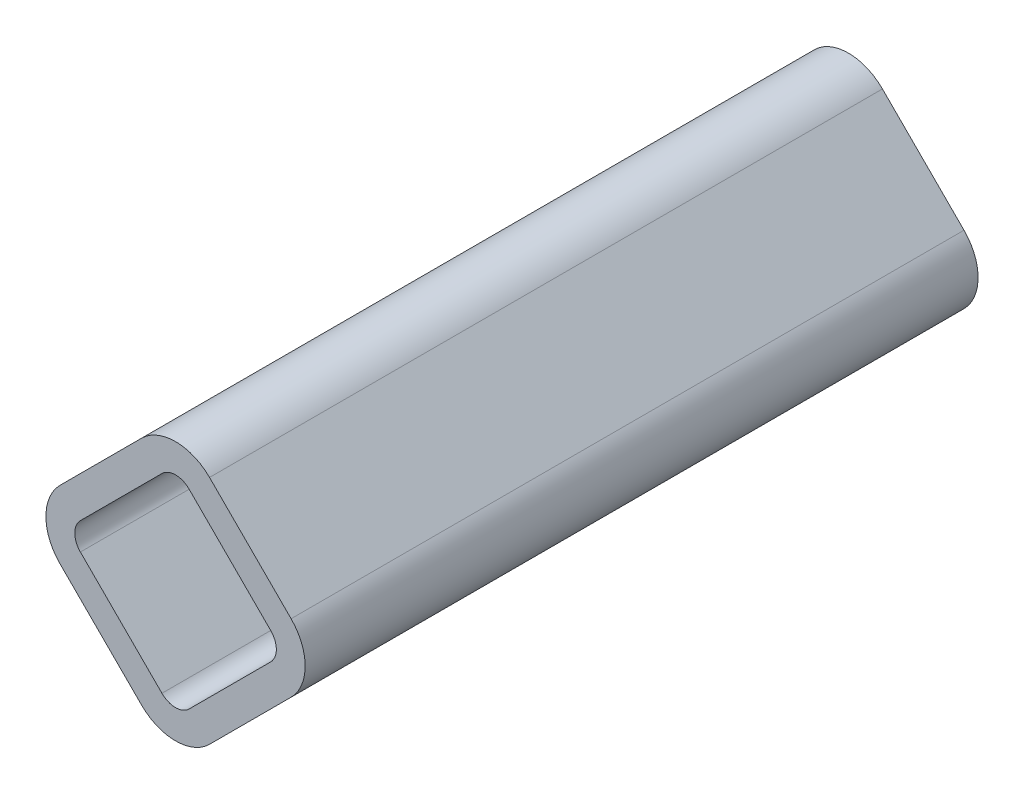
ISO-10303-21;
HEADER;
FILE_DESCRIPTION(('STEP AP214'),'2;1');
FILE_NAME('part.step','',(''),(''),'','','');
FILE_SCHEMA(('AUTOMOTIVE_DESIGN { 1 0 10303 214 1 1 1 1 }'));
ENDSEC;
DATA;
#1=APPLICATION_CONTEXT('core data for automotive mechanical design processes');
#2=APPLICATION_PROTOCOL_DEFINITION('international standard','automotive_design',2000,#1);
#3=PRODUCT_CONTEXT('',#1,'mechanical');
#4=PRODUCT('Part','Part','',(#3));
#5=PRODUCT_RELATED_PRODUCT_CATEGORY('part','',(#4));
#6=PRODUCT_DEFINITION_FORMATION('','',#4);
#7=PRODUCT_DEFINITION_CONTEXT('part definition',#1,'design');
#8=PRODUCT_DEFINITION('design','',#6,#7);
#9=PRODUCT_DEFINITION_SHAPE('','',#8);
#10=(LENGTH_UNIT() NAMED_UNIT(*) SI_UNIT(.MILLI.,.METRE.));
#11=(NAMED_UNIT(*) PLANE_ANGLE_UNIT() SI_UNIT($,.RADIAN.));
#12=(NAMED_UNIT(*) SI_UNIT($,.STERADIAN.) SOLID_ANGLE_UNIT());
#13=UNCERTAINTY_MEASURE_WITH_UNIT(LENGTH_MEASURE(1.E-05),#10,'distance_accuracy_value','');
#14=(GEOMETRIC_REPRESENTATION_CONTEXT(3) GLOBAL_UNCERTAINTY_ASSIGNED_CONTEXT((#13)) GLOBAL_UNIT_ASSIGNED_CONTEXT((#10,
#11,#12)) REPRESENTATION_CONTEXT('',''));
#15=CARTESIAN_POINT('',(0.,0.,0.));
#16=DIRECTION('',(0.,0.,1.));
#17=DIRECTION('',(1.,0.,0.));
#18=AXIS2_PLACEMENT_3D('',#15,#16,#17);
#19=CARTESIAN_POINT('',(-1.55771785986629E-08,4.24264070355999,11.));
#20=DIRECTION('',(0.,0.,1.));
#21=DIRECTION('',(0.,-1.,0.));
#22=AXIS2_PLACEMENT_3D('',#19,#20,#21);
#23=CYLINDRICAL_SURFACE('',#22,1.00000000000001);
#24=CARTESIAN_POINT('',(-1.55771785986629E-08,4.24264070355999,11.));
#25=DIRECTION('',(0.,0.,1.));
#26=DIRECTION('',(0.,-1.,0.));
#27=AXIS2_PLACEMENT_3D('',#24,#25,#26);
#28=CIRCLE('',#27,1.00000000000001);
#29=CARTESIAN_POINT('',(-0.707106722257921,4.94974755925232,11.));
#30=VERTEX_POINT('',#29);
#31=CARTESIAN_POINT('',(0.707106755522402,4.94974749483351,11.));
#32=VERTEX_POINT('',#31);
#33=EDGE_CURVE('E127',#30,#32,#28,.F.);
#34=ORIENTED_EDGE('',*,*,#33,.T.);
#35=DIRECTION('',(0.,0.,-1.));
#36=VECTOR('',#35,1.);
#37=CARTESIAN_POINT('',(0.707106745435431,4.94974750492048,28.5));
#38=LINE('',#37,#36);
#39=CARTESIAN_POINT('',(0.70710675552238,4.94974749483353,46.));
#40=VERTEX_POINT('',#39);
#41=EDGE_CURVE('E125',#40,#32,#38,.T.);
#42=ORIENTED_EDGE('',*,*,#41,.F.);
#43=CARTESIAN_POINT('',(-1.55771785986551E-08,4.24264070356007,46.));
#44=DIRECTION('',(0.,0.,1.));
#45=DIRECTION('',(0.,-1.,0.));
#46=AXIS2_PLACEMENT_3D('',#43,#44,#45);
#47=CIRCLE('',#46,1.00000000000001);
#48=CARTESIAN_POINT('',(-0.7071067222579,4.94974755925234,46.));
#49=VERTEX_POINT('',#48);
#50=EDGE_CURVE('E20',#40,#49,#47,.T.);
#51=ORIENTED_EDGE('',*,*,#50,.T.);
#52=DIRECTION('',(0.,0.,1.));
#53=VECTOR('',#52,1.);
#54=CARTESIAN_POINT('',(-0.707106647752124,4.94974763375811,28.5));
#55=LINE('',#54,#53);
#56=EDGE_CURVE('E122',#30,#49,#55,.T.);
#57=ORIENTED_EDGE('',*,*,#56,.F.);
#58=EDGE_LOOP('',(#34,#42,#51,#57));
#59=FACE_BOUND('',#58,.T.);
#60=ADVANCED_FACE('F16',(#59),#23,.F.);
#61=CARTESIAN_POINT('',(1.76069614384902,-6.01747830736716,10.99));
#62=DIRECTION('',(0.707106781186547,-0.707106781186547,0.));
#63=DIRECTION('',(0.707106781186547,0.707106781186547,0.));
#64=AXIS2_PLACEMENT_3D('',#61,#62,#63);
#65=PLANE('',#64);
#66=DIRECTION('',(-0.707106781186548,-0.707106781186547,0.));
#67=VECTOR('',#66,1.);
#68=CARTESIAN_POINT('',(6.01040765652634,-1.76776679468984,11.));
#69=LINE('',#68,#67);
#70=CARTESIAN_POINT('',(6.01040768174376,-1.76776676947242,11.));
#71=VERTEX_POINT('',#70);
#72=CARTESIAN_POINT('',(1.76776721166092,-6.01040723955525,11.));
#73=VERTEX_POINT('',#72);
#74=EDGE_CURVE('E219',#71,#73,#69,.T.);
#75=ORIENTED_EDGE('',*,*,#74,.F.);
#76=DIRECTION('',(0.,0.,-1.));
#77=VECTOR('',#76,1.);
#78=CARTESIAN_POINT('',(6.01040765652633,-1.76776679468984,28.5));
#79=LINE('',#78,#77);
#80=CARTESIAN_POINT('',(6.01040768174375,-1.76776676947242,46.));
#81=VERTEX_POINT('',#80);
#82=EDGE_CURVE('E247',#81,#71,#79,.T.);
#83=ORIENTED_EDGE('',*,*,#82,.F.);
#84=DIRECTION('',(0.707106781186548,0.707106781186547,0.));
#85=VECTOR('',#84,1.);
#86=CARTESIAN_POINT('',(1.76776721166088,-6.01040723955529,46.));
#87=LINE('',#86,#85);
#88=CARTESIAN_POINT('',(1.76776721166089,-6.01040723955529,46.));
#89=VERTEX_POINT('',#88);
#90=EDGE_CURVE('E169',#89,#81,#87,.T.);
#91=ORIENTED_EDGE('',*,*,#90,.F.);
#92=DIRECTION('',(0.,0.,1.));
#93=VECTOR('',#92,1.);
#94=CARTESIAN_POINT('',(1.76776721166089,-6.01040723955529,28.5));
#95=LINE('',#94,#93);
#96=EDGE_CURVE('E174',#73,#89,#95,.T.);
#97=ORIENTED_EDGE('',*,*,#96,.F.);
#98=EDGE_LOOP('',(#75,#83,#91,#97));
#99=FACE_BOUND('',#98,.T.);
#100=ADVANCED_FACE('F275',(#99),#65,.T.);
#101=CARTESIAN_POINT('',(2.58694522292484E-07,-4.24264028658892,46.));
#102=DIRECTION('',(0.,0.,-1.));
#103=DIRECTION('',(0.,1.,0.));
#104=AXIS2_PLACEMENT_3D('',#101,#102,#103);
#105=CYLINDRICAL_SURFACE('',#104,2.5);
#106=CARTESIAN_POINT('',(2.58694522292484E-07,-4.24264028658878,11.));
#107=DIRECTION('',(0.,0.,-1.));
#108=DIRECTION('',(0.,1.,0.));
#109=AXIS2_PLACEMENT_3D('',#106,#107,#108);
#110=CIRCLE('',#109,2.5);
#111=CARTESIAN_POINT('',(-1.76776669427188,-6.01040723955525,11.));
#112=VERTEX_POINT('',#111);
#113=EDGE_CURVE('E216',#73,#112,#110,.T.);
#114=ORIENTED_EDGE('',*,*,#113,.F.);
#115=ORIENTED_EDGE('',*,*,#96,.T.);
#116=CARTESIAN_POINT('',(2.58694522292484E-07,-4.24264028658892,46.));
#117=DIRECTION('',(0.,0.,-1.));
#118=DIRECTION('',(0.,1.,0.));
#119=AXIS2_PLACEMENT_3D('',#116,#117,#118);
#120=CIRCLE('',#119,2.5);
#121=CARTESIAN_POINT('',(-1.76776669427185,-6.01040723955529,46.));
#122=VERTEX_POINT('',#121);
#123=EDGE_CURVE('E172',#122,#89,#120,.F.);
#124=ORIENTED_EDGE('',*,*,#123,.F.);
#125=DIRECTION('',(0.,0.,1.));
#126=VECTOR('',#125,1.);
#127=CARTESIAN_POINT('',(-1.76776669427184,-6.01040723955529,28.5));
#128=LINE('',#127,#126);
#129=EDGE_CURVE('E175',#112,#122,#128,.T.);
#130=ORIENTED_EDGE('',*,*,#129,.F.);
#131=EDGE_LOOP('',(#114,#115,#124,#130));
#132=FACE_BOUND('',#131,.T.);
#133=ADVANCED_FACE('F272',(#132),#105,.T.);
#134=CARTESIAN_POINT('',(-6.01747832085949,-1.76069561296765,10.99));
#135=DIRECTION('',(-0.707106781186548,-0.707106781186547,0.));
#136=DIRECTION('',(0.707106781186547,-0.707106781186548,0.));
#137=AXIS2_PLACEMENT_3D('',#134,#135,#136);
#138=PLANE('',#137);
#139=DIRECTION('',(-0.707106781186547,0.707106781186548,0.));
#140=VECTOR('',#139,1.);
#141=CARTESIAN_POINT('',(-1.76776669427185,-6.01040723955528,11.));
#142=LINE('',#141,#140);
#143=CARTESIAN_POINT('',(-6.01040722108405,-1.76776671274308,11.));
#144=VERTEX_POINT('',#143);
#145=EDGE_CURVE('E213',#112,#144,#142,.T.);
#146=ORIENTED_EDGE('',*,*,#145,.F.);
#147=ORIENTED_EDGE('',*,*,#129,.T.);
#148=DIRECTION('',(0.707106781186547,-0.707106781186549,0.));
#149=VECTOR('',#148,1.);
#150=CARTESIAN_POINT('',(-6.01040725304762,-1.76776668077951,46.));
#151=LINE('',#150,#149);
#152=CARTESIAN_POINT('',(-6.01040722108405,-1.76776671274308,46.));
#153=VERTEX_POINT('',#152);
#154=EDGE_CURVE('E148',#153,#122,#151,.T.);
#155=ORIENTED_EDGE('',*,*,#154,.F.);
#156=DIRECTION('',(0.,0.,1.));
#157=VECTOR('',#156,1.);
#158=CARTESIAN_POINT('',(-6.01040725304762,-1.76776668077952,28.5));
#159=LINE('',#158,#157);
#160=EDGE_CURVE('E181',#144,#153,#159,.T.);
#161=ORIENTED_EDGE('',*,*,#160,.F.);
#162=EDGE_LOOP('',(#146,#147,#155,#161));
#163=FACE_BOUND('',#162,.T.);
#164=ADVANCED_FACE('F263',(#163),#138,.T.);
#165=CARTESIAN_POINT('',(-4.24264023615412,2.08259709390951E-07,46.));
#166=DIRECTION('',(0.,0.,-1.));
#167=DIRECTION('',(-1.,0.,0.));
#168=AXIS2_PLACEMENT_3D('',#165,#166,#167);
#169=CYLINDRICAL_SURFACE('',#168,2.5);
#170=CARTESIAN_POINT('',(-4.24264023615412,2.08259709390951E-07,11.));
#171=DIRECTION('',(0.,0.,-1.));
#172=DIRECTION('',(-1.,0.,0.));
#173=AXIS2_PLACEMENT_3D('',#170,#171,#172);
#174=CIRCLE('',#173,2.5);
#175=CARTESIAN_POINT('',(-6.01040742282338,1.76776692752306,11.));
#176=VERTEX_POINT('',#175);
#177=EDGE_CURVE('E210',#144,#176,#174,.T.);
#178=ORIENTED_EDGE('',*,*,#177,.F.);
#179=ORIENTED_EDGE('',*,*,#160,.T.);
#180=CARTESIAN_POINT('',(-4.24264023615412,2.08259709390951E-07,46.));
#181=DIRECTION('',(0.,0.,-1.));
#182=DIRECTION('',(-1.,0.,0.));
#183=AXIS2_PLACEMENT_3D('',#180,#181,#182);
#184=CIRCLE('',#183,2.5);
#185=CARTESIAN_POINT('',(-6.01040742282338,1.76776692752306,46.));
#186=VERTEX_POINT('',#185);
#187=EDGE_CURVE('E154',#186,#153,#184,.F.);
#188=ORIENTED_EDGE('',*,*,#187,.F.);
#189=DIRECTION('',(0.,0.,1.));
#190=VECTOR('',#189,1.);
#191=CARTESIAN_POINT('',(-6.01040765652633,1.76776669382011,28.5));
#192=LINE('',#191,#190);
#193=EDGE_CURVE('E255',#176,#186,#192,.T.);
#194=ORIENTED_EDGE('',*,*,#193,.F.);
#195=EDGE_LOOP('',(#178,#179,#188,#194));
#196=FACE_BOUND('',#195,.T.);
#197=ADVANCED_FACE('F260',(#196),#169,.T.);
#198=CARTESIAN_POINT('',(-1.76069562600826,6.01747872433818,10.99));
#199=DIRECTION('',(-0.707106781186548,0.707106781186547,0.));
#200=DIRECTION('',(-0.707106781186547,-0.707106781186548,0.));
#201=AXIS2_PLACEMENT_3D('',#198,#199,#200);
#202=PLANE('',#201);
#203=DIRECTION('',(0.707106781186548,0.707106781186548,0.));
#204=VECTOR('',#203,1.);
#205=CARTESIAN_POINT('',(-6.01040765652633,1.76776669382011,11.));
#206=LINE('',#205,#204);
#207=CARTESIAN_POINT('',(-1.76776669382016,6.01040765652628,11.));
#208=VERTEX_POINT('',#207);
#209=EDGE_CURVE('E207',#176,#208,#206,.T.);
#210=ORIENTED_EDGE('',*,*,#209,.F.);
#211=ORIENTED_EDGE('',*,*,#193,.T.);
#212=DIRECTION('',(-0.707106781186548,-0.707106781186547,0.));
#213=VECTOR('',#212,1.);
#214=CARTESIAN_POINT('',(-1.76776669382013,6.01040765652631,46.));
#215=LINE('',#214,#213);
#216=CARTESIAN_POINT('',(-1.76776669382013,6.01040765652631,46.));
#217=VERTEX_POINT('',#216);
#218=EDGE_CURVE('E157',#217,#186,#215,.T.);
#219=ORIENTED_EDGE('',*,*,#218,.F.);
#220=DIRECTION('',(0.,0.,1.));
#221=VECTOR('',#220,1.);
#222=CARTESIAN_POINT('',(-1.76776669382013,6.01040765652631,28.5));
#223=LINE('',#222,#221);
#224=EDGE_CURVE('E253',#208,#217,#223,.T.);
#225=ORIENTED_EDGE('',*,*,#224,.F.);
#226=EDGE_LOOP('',(#210,#211,#219,#225));
#227=FACE_BOUND('',#226,.T.);
#228=ADVANCED_FACE('F268',(#227),#202,.T.);
#229=CARTESIAN_POINT('',(2.59146241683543E-07,4.24264070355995,46.));
#230=DIRECTION('',(0.,0.,-1.));
#231=DIRECTION('',(0.,1.,0.));
#232=AXIS2_PLACEMENT_3D('',#229,#230,#231);
#233=CYLINDRICAL_SURFACE('',#232,2.5);
#234=CARTESIAN_POINT('',(2.59146241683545E-07,4.24264070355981,11.));
#235=DIRECTION('',(0.,0.,-1.));
#236=DIRECTION('',(0.,1.,0.));
#237=AXIS2_PLACEMENT_3D('',#234,#235,#236);
#238=CIRCLE('',#237,2.5);
#239=CARTESIAN_POINT('',(1.76776718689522,6.0104076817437,11.));
#240=VERTEX_POINT('',#239);
#241=EDGE_CURVE('E204',#208,#240,#238,.T.);
#242=ORIENTED_EDGE('',*,*,#241,.F.);
#243=ORIENTED_EDGE('',*,*,#224,.T.);
#244=CARTESIAN_POINT('',(2.59146241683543E-07,4.24264070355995,46.));
#245=DIRECTION('',(0.,0.,-1.));
#246=DIRECTION('',(0.,1.,0.));
#247=AXIS2_PLACEMENT_3D('',#244,#245,#246);
#248=CIRCLE('',#247,2.5);
#249=CARTESIAN_POINT('',(1.76776718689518,6.01040768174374,46.));
#250=VERTEX_POINT('',#249);
#251=EDGE_CURVE('E160',#250,#217,#248,.F.);
#252=ORIENTED_EDGE('',*,*,#251,.F.);
#253=DIRECTION('',(0.,0.,1.));
#254=VECTOR('',#253,1.);
#255=CARTESIAN_POINT('',(1.76776716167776,6.01040770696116,28.5));
#256=LINE('',#255,#254);
#257=EDGE_CURVE('E250',#240,#250,#256,.T.);
#258=ORIENTED_EDGE('',*,*,#257,.F.);
#259=EDGE_LOOP('',(#242,#243,#252,#258));
#260=FACE_BOUND('',#259,.T.);
#261=ADVANCED_FACE('F284',(#260),#233,.T.);
#262=CARTESIAN_POINT('',(6.01747877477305,1.76069609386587,10.99));
#263=DIRECTION('',(0.707106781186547,0.707106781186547,0.));
#264=DIRECTION('',(-0.707106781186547,0.707106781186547,0.));
#265=AXIS2_PLACEMENT_3D('',#262,#263,#264);
#266=PLANE('',#265);
#267=DIRECTION('',(0.707106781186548,-0.707106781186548,0.));
#268=VECTOR('',#267,1.);
#269=CARTESIAN_POINT('',(1.76776716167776,6.01040770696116,11.));
#270=LINE('',#269,#268);
#271=CARTESIAN_POINT('',(6.01040770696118,1.76776716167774,11.));
#272=VERTEX_POINT('',#271);
#273=EDGE_CURVE('E201',#240,#272,#270,.T.);
#274=ORIENTED_EDGE('',*,*,#273,.F.);
#275=ORIENTED_EDGE('',*,*,#257,.T.);
#276=DIRECTION('',(-0.707106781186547,0.707106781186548,0.));
#277=VECTOR('',#276,1.);
#278=CARTESIAN_POINT('',(6.01040770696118,1.76776716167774,46.));
#279=LINE('',#278,#277);
#280=CARTESIAN_POINT('',(6.01040770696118,1.76776716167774,46.));
#281=VERTEX_POINT('',#280);
#282=EDGE_CURVE('E163',#281,#250,#279,.T.);
#283=ORIENTED_EDGE('',*,*,#282,.F.);
#284=DIRECTION('',(0.,0.,1.));
#285=VECTOR('',#284,1.);
#286=CARTESIAN_POINT('',(6.01040770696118,1.76776716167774,28.5));
#287=LINE('',#286,#285);
#288=EDGE_CURVE('E245',#272,#281,#287,.T.);
#289=ORIENTED_EDGE('',*,*,#288,.F.);
#290=EDGE_LOOP('',(#274,#275,#283,#289));
#291=FACE_BOUND('',#290,.T.);
#292=ADVANCED_FACE('F282',(#291),#266,.T.);
#293=CARTESIAN_POINT('',(4.24264075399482,2.08711370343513E-07,46.));
#294=DIRECTION('',(0.,0.,-1.));
#295=DIRECTION('',(-1.,0.,0.));
#296=AXIS2_PLACEMENT_3D('',#293,#294,#295);
#297=CYLINDRICAL_SURFACE('',#296,2.49999999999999);
#298=CARTESIAN_POINT('',(4.24264075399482,2.08711370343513E-07,11.));
#299=DIRECTION('',(0.,0.,-1.));
#300=DIRECTION('',(-1.,0.,0.));
#301=AXIS2_PLACEMENT_3D('',#298,#299,#300);
#302=CIRCLE('',#301,2.49999999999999);
#303=EDGE_CURVE('E198',#272,#71,#302,.T.);
#304=ORIENTED_EDGE('',*,*,#303,.F.);
#305=ORIENTED_EDGE('',*,*,#288,.T.);
#306=CARTESIAN_POINT('',(4.24264075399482,2.08711370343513E-07,46.));
#307=DIRECTION('',(0.,0.,-1.));
#308=DIRECTION('',(-1.,0.,0.));
#309=AXIS2_PLACEMENT_3D('',#306,#307,#308);
#310=CIRCLE('',#309,2.49999999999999);
#311=EDGE_CURVE('E166',#81,#281,#310,.F.);
#312=ORIENTED_EDGE('',*,*,#311,.F.);
#313=ORIENTED_EDGE('',*,*,#82,.T.);
#314=EDGE_LOOP('',(#304,#305,#312,#313));
#315=FACE_BOUND('',#314,.T.);
#316=ADVANCED_FACE('F278',(#315),#297,.T.);
#317=CARTESIAN_POINT('',(0.700035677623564,4.95681857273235,10.99));
#318=DIRECTION('',(-0.707106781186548,-0.707106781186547,0.));
#319=DIRECTION('',(0.707106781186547,-0.707106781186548,0.));
#320=AXIS2_PLACEMENT_3D('',#317,#318,#319);
#321=PLANE('',#320);
#322=DIRECTION('',(-0.707106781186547,0.707106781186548,0.));
#323=VECTOR('',#322,1.);
#324=CARTESIAN_POINT('',(4.94974754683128,0.707106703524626,11.));
#325=LINE('',#324,#323);
#326=CARTESIAN_POINT('',(4.94974747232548,0.707106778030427,11.));
#327=VERTEX_POINT('',#326);
#328=EDGE_CURVE('E191',#327,#32,#325,.T.);
#329=ORIENTED_EDGE('',*,*,#328,.F.);
#330=DIRECTION('',(0.,0.,-1.));
#331=VECTOR('',#330,1.);
#332=CARTESIAN_POINT('',(4.94974754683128,0.707106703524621,28.5));
#333=LINE('',#332,#331);
#334=CARTESIAN_POINT('',(4.94974747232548,0.707106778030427,46.));
#335=VERTEX_POINT('',#334);
#336=EDGE_CURVE('E135',#335,#327,#333,.T.);
#337=ORIENTED_EDGE('',*,*,#336,.F.);
#338=DIRECTION('',(0.707106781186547,-0.707106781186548,0.));
#339=VECTOR('',#338,1.);
#340=CARTESIAN_POINT('',(0.707106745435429,4.94974750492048,46.));
#341=LINE('',#340,#339);
#342=EDGE_CURVE('E143',#40,#335,#341,.T.);
#343=ORIENTED_EDGE('',*,*,#342,.F.);
#344=ORIENTED_EDGE('',*,*,#41,.T.);
#345=EDGE_LOOP('',(#329,#337,#343,#344));
#346=FACE_BOUND('',#345,.T.);
#347=ADVANCED_FACE('F319',(#346),#321,.T.);
#348=CARTESIAN_POINT('',(-4.95681854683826,0.700035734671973,10.99));
#349=DIRECTION('',(0.707106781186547,-0.707106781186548,0.));
#350=DIRECTION('',(0.707106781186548,0.707106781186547,0.));
#351=AXIS2_PLACEMENT_3D('',#348,#349,#350);
#352=PLANE('',#351);
#353=DIRECTION('',(-0.707106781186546,-0.707106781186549,0.));
#354=VECTOR('',#353,1.);
#355=CARTESIAN_POINT('',(-0.707106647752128,4.94974763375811,11.));
#356=LINE('',#355,#354);
#357=CARTESIAN_POINT('',(-4.94974738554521,0.707106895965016,11.));
#358=VERTEX_POINT('',#357);
#359=EDGE_CURVE('E134',#30,#358,#356,.T.);
#360=ORIENTED_EDGE('',*,*,#359,.F.);
#361=ORIENTED_EDGE('',*,*,#56,.T.);
#362=DIRECTION('',(0.707106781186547,0.707106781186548,0.));
#363=VECTOR('',#362,1.);
#364=CARTESIAN_POINT('',(-4.94974747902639,0.707106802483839,46.));
#365=LINE('',#364,#363);
#366=CARTESIAN_POINT('',(-4.94974738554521,0.707106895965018,46.));
#367=VERTEX_POINT('',#366);
#368=EDGE_CURVE('E131',#367,#49,#365,.T.);
#369=ORIENTED_EDGE('',*,*,#368,.F.);
#370=DIRECTION('',(0.,0.,1.));
#371=VECTOR('',#370,1.);
#372=CARTESIAN_POINT('',(-4.94974747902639,0.707106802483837,28.5));
#373=LINE('',#372,#371);
#374=EDGE_CURVE('E188',#358,#367,#373,.T.);
#375=ORIENTED_EDGE('',*,*,#374,.F.);
#376=EDGE_LOOP('',(#360,#361,#369,#375));
#377=FACE_BOUND('',#376,.T.);
#378=ADVANCED_FACE('F129',(#377),#352,.T.);
#379=CARTESIAN_POINT('',(4.24264061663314,7.13496994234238E-08,11.));
#380=DIRECTION('',(0.,0.,1.));
#381=DIRECTION('',(1.,0.,0.));
#382=AXIS2_PLACEMENT_3D('',#379,#380,#381);
#383=CYLINDRICAL_SURFACE('',#382,1.);
#384=CARTESIAN_POINT('',(4.24264061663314,7.13496994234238E-08,11.));
#385=DIRECTION('',(0.,0.,1.));
#386=DIRECTION('',(1.,0.,0.));
#387=AXIS2_PLACEMENT_3D('',#384,#385,#386);
#388=CIRCLE('',#387,1.);
#389=CARTESIAN_POINT('',(4.94974738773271,-0.707106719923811,11.));
#390=VERTEX_POINT('',#389);
#391=EDGE_CURVE('E194',#390,#327,#388,.T.);
#392=ORIENTED_EDGE('',*,*,#391,.F.);
#393=DIRECTION('',(0.,0.,-1.));
#394=VECTOR('',#393,1.);
#395=CARTESIAN_POINT('',(4.94974737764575,-0.707106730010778,28.5));
#396=LINE('',#395,#394);
#397=CARTESIAN_POINT('',(4.94974738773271,-0.707106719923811,46.));
#398=VERTEX_POINT('',#397);
#399=EDGE_CURVE('E231',#398,#390,#396,.T.);
#400=ORIENTED_EDGE('',*,*,#399,.F.);
#401=CARTESIAN_POINT('',(4.24264061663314,7.13496994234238E-08,46.));
#402=DIRECTION('',(0.,0.,1.));
#403=DIRECTION('',(1.,0.,0.));
#404=AXIS2_PLACEMENT_3D('',#401,#402,#403);
#405=CIRCLE('',#404,1.);
#406=EDGE_CURVE('E146',#335,#398,#405,.F.);
#407=ORIENTED_EDGE('',*,*,#406,.F.);
#408=ORIENTED_EDGE('',*,*,#336,.T.);
#409=EDGE_LOOP('',(#392,#400,#407,#408));
#410=FACE_BOUND('',#409,.T.);
#411=ADVANCED_FACE('F232',(#410),#383,.F.);
#412=CARTESIAN_POINT('',(6.75264076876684,-7.78817419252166,46.));
#413=DIRECTION('',(0.,0.,1.));
#414=DIRECTION('',(0.,1.,0.));
#415=AXIS2_PLACEMENT_3D('',#412,#413,#414);
#416=PLANE('',#415);
#417=ORIENTED_EDGE('',*,*,#406,.T.);
#418=DIRECTION('',(0.707106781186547,0.707106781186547,0.));
#419=VECTOR('',#418,1.);
#420=CARTESIAN_POINT('',(2.82842706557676,-2.82842704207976,46.));
#421=LINE('',#420,#419);
#422=CARTESIAN_POINT('',(0.707106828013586,-4.94974727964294,46.));
#423=VERTEX_POINT('',#422);
#424=EDGE_CURVE('E225',#423,#398,#421,.T.);
#425=ORIENTED_EDGE('',*,*,#424,.F.);
#426=CARTESIAN_POINT('',(1.21332862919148E-07,-4.24264042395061,46.));
#427=DIRECTION('',(0.,0.,1.));
#428=DIRECTION('',(1.,0.,0.));
#429=AXIS2_PLACEMENT_3D('',#426,#427,#428);
#430=CIRCLE('',#429,1.);
#431=CARTESIAN_POINT('',(-0.707106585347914,-4.94974727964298,46.));
#432=VERTEX_POINT('',#431);
#433=EDGE_CURVE('E144',#423,#432,#430,.F.);
#434=ORIENTED_EDGE('',*,*,#433,.T.);
#435=DIRECTION('',(0.707106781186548,-0.707106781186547,0.));
#436=VECTOR('',#435,1.);
#437=CARTESIAN_POINT('',(-2.82842691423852,-2.8284269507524,46.));
#438=LINE('',#437,#436);
#439=CARTESIAN_POINT('',(-4.94974730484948,-0.707106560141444,46.));
#440=VERTEX_POINT('',#439);
#441=EDGE_CURVE('E486',#440,#432,#438,.T.);
#442=ORIENTED_EDGE('',*,*,#441,.F.);
#443=CARTESIAN_POINT('',(-4.24264051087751,2.08259676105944E-07,46.));
#444=DIRECTION('',(0.,0.,1.));
#445=DIRECTION('',(1.,0.,0.));
#446=AXIS2_PLACEMENT_3D('',#443,#444,#445);
#447=CIRCLE('',#446,1.);
#448=EDGE_CURVE('E141',#367,#440,#447,.T.);
#449=ORIENTED_EDGE('',*,*,#448,.F.);
#450=ORIENTED_EDGE('',*,*,#368,.T.);
#451=ORIENTED_EDGE('',*,*,#50,.F.);
#452=ORIENTED_EDGE('',*,*,#342,.T.);
#453=EDGE_LOOP('',(#417,#425,#434,#442,#449,#450,#451,#452));
#454=FACE_BOUND('',#453,.T.);
#455=ORIENTED_EDGE('',*,*,#187,.T.);
#456=ORIENTED_EDGE('',*,*,#154,.T.);
#457=ORIENTED_EDGE('',*,*,#123,.T.);
#458=ORIENTED_EDGE('',*,*,#90,.T.);
#459=ORIENTED_EDGE('',*,*,#311,.T.);
#460=ORIENTED_EDGE('',*,*,#282,.T.);
#461=ORIENTED_EDGE('',*,*,#251,.T.);
#462=ORIENTED_EDGE('',*,*,#218,.T.);
#463=EDGE_LOOP('',(#455,#456,#457,#458,#459,#460,#461,#462));
#464=FACE_BOUND('',#463,.T.);
#465=ADVANCED_FACE('F137',(#454,#464),#416,.T.);
#466=CARTESIAN_POINT('',(6.75264076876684,7.78817455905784,11.));
#467=DIRECTION('',(0.,0.,-1.));
#468=DIRECTION('',(0.,-1.,0.));
#469=AXIS2_PLACEMENT_3D('',#466,#467,#468);
#470=PLANE('',#469);
#471=CARTESIAN_POINT('',(-4.24264051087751,2.08259676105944E-07,11.));
#472=DIRECTION('',(0.,0.,1.));
#473=DIRECTION('',(1.,0.,0.));
#474=AXIS2_PLACEMENT_3D('',#471,#472,#473);
#475=CIRCLE('',#474,1.);
#476=CARTESIAN_POINT('',(-4.94974730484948,-0.707106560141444,11.));
#477=VERTEX_POINT('',#476);
#478=EDGE_CURVE('E185',#477,#358,#475,.F.);
#479=ORIENTED_EDGE('',*,*,#478,.F.);
#480=DIRECTION('',(-0.707106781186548,0.707106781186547,0.));
#481=VECTOR('',#480,1.);
#482=CARTESIAN_POINT('',(-2.82842691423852,-2.8284269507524,11.));
#483=LINE('',#482,#481);
#484=CARTESIAN_POINT('',(-0.7071065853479,-4.94974727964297,11.));
#485=VERTEX_POINT('',#484);
#486=EDGE_CURVE('E488',#485,#477,#483,.T.);
#487=ORIENTED_EDGE('',*,*,#486,.F.);
#488=CARTESIAN_POINT('',(1.21332862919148E-07,-4.24264042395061,11.));
#489=DIRECTION('',(0.,0.,1.));
#490=DIRECTION('',(1.,0.,0.));
#491=AXIS2_PLACEMENT_3D('',#488,#489,#490);
#492=CIRCLE('',#491,1.);
#493=CARTESIAN_POINT('',(0.707106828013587,-4.94974727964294,11.));
#494=VERTEX_POINT('',#493);
#495=EDGE_CURVE('E34',#485,#494,#492,.T.);
#496=ORIENTED_EDGE('',*,*,#495,.T.);
#497=DIRECTION('',(-0.707106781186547,-0.707106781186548,0.));
#498=VECTOR('',#497,1.);
#499=CARTESIAN_POINT('',(2.82842706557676,-2.82842704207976,11.));
#500=LINE('',#499,#498);
#501=EDGE_CURVE('E236',#390,#494,#500,.T.);
#502=ORIENTED_EDGE('',*,*,#501,.F.);
#503=ORIENTED_EDGE('',*,*,#391,.T.);
#504=ORIENTED_EDGE('',*,*,#328,.T.);
#505=ORIENTED_EDGE('',*,*,#33,.F.);
#506=ORIENTED_EDGE('',*,*,#359,.T.);
#507=EDGE_LOOP('',(#479,#487,#496,#502,#503,#504,#505,#506));
#508=FACE_BOUND('',#507,.T.);
#509=ORIENTED_EDGE('',*,*,#273,.T.);
#510=ORIENTED_EDGE('',*,*,#303,.T.);
#511=ORIENTED_EDGE('',*,*,#74,.T.);
#512=ORIENTED_EDGE('',*,*,#113,.T.);
#513=ORIENTED_EDGE('',*,*,#145,.T.);
#514=ORIENTED_EDGE('',*,*,#177,.T.);
#515=ORIENTED_EDGE('',*,*,#209,.T.);
#516=ORIENTED_EDGE('',*,*,#241,.T.);
#517=EDGE_LOOP('',(#509,#510,#511,#512,#513,#514,#515,#516));
#518=FACE_BOUND('',#517,.T.);
#519=ADVANCED_FACE('F271',(#508,#518),#470,.T.);
#520=CARTESIAN_POINT('',(-4.24264051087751,2.08259676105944E-07,11.));
#521=DIRECTION('',(0.,0.,1.));
#522=DIRECTION('',(1.,0.,0.));
#523=AXIS2_PLACEMENT_3D('',#520,#521,#522);
#524=CYLINDRICAL_SURFACE('',#523,1.);
#525=ORIENTED_EDGE('',*,*,#478,.T.);
#526=ORIENTED_EDGE('',*,*,#374,.T.);
#527=ORIENTED_EDGE('',*,*,#448,.T.);
#528=DIRECTION('',(0.,0.,1.));
#529=VECTOR('',#528,1.);
#530=CARTESIAN_POINT('',(-4.94974731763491,-0.707106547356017,28.5));
#531=LINE('',#530,#529);
#532=EDGE_CURVE('E491',#477,#440,#531,.T.);
#533=ORIENTED_EDGE('',*,*,#532,.F.);
#534=EDGE_LOOP('',(#525,#526,#527,#533));
#535=FACE_BOUND('',#534,.T.);
#536=ADVANCED_FACE('F303',(#535),#524,.F.);
#537=CARTESIAN_POINT('',(4.95681844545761,-0.700035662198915,10.99));
#538=DIRECTION('',(-0.707106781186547,0.707106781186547,0.));
#539=DIRECTION('',(-0.707106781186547,-0.707106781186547,0.));
#540=AXIS2_PLACEMENT_3D('',#537,#538,#539);
#541=PLANE('',#540);
#542=ORIENTED_EDGE('',*,*,#501,.T.);
#543=DIRECTION('',(0.,0.,-1.));
#544=VECTOR('',#543,1.);
#545=CARTESIAN_POINT('',(0.707106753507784,-4.94974735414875,28.5));
#546=LINE('',#545,#544);
#547=EDGE_CURVE('E26',#423,#494,#546,.T.);
#548=ORIENTED_EDGE('',*,*,#547,.F.);
#549=ORIENTED_EDGE('',*,*,#424,.T.);
#550=ORIENTED_EDGE('',*,*,#399,.T.);
#551=EDGE_LOOP('',(#542,#548,#549,#550));
#552=FACE_BOUND('',#551,.T.);
#553=ADVANCED_FACE('F238',(#552),#541,.T.);
#554=CARTESIAN_POINT('',(-0.700035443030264,-4.95681842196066,10.99));
#555=DIRECTION('',(0.707106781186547,0.707106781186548,0.));
#556=DIRECTION('',(-0.707106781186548,0.707106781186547,0.));
#557=AXIS2_PLACEMENT_3D('',#554,#555,#556);
#558=PLANE('',#557);
#559=ORIENTED_EDGE('',*,*,#486,.T.);
#560=ORIENTED_EDGE('',*,*,#532,.T.);
#561=ORIENTED_EDGE('',*,*,#441,.T.);
#562=DIRECTION('',(0.,0.,1.));
#563=VECTOR('',#562,1.);
#564=CARTESIAN_POINT('',(-0.707106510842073,-4.94974735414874,28.5));
#565=LINE('',#564,#563);
#566=EDGE_CURVE('E11',#485,#432,#565,.T.);
#567=ORIENTED_EDGE('',*,*,#566,.F.);
#568=EDGE_LOOP('',(#559,#560,#561,#567));
#569=FACE_BOUND('',#568,.T.);
#570=ADVANCED_FACE('F295',(#569),#558,.T.);
#571=CARTESIAN_POINT('',(1.21332862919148E-07,-4.24264042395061,11.));
#572=DIRECTION('',(0.,0.,1.));
#573=DIRECTION('',(1.,0.,0.));
#574=AXIS2_PLACEMENT_3D('',#571,#572,#573);
#575=CYLINDRICAL_SURFACE('',#574,1.);
#576=ORIENTED_EDGE('',*,*,#495,.F.);
#577=ORIENTED_EDGE('',*,*,#566,.T.);
#578=ORIENTED_EDGE('',*,*,#433,.F.);
#579=ORIENTED_EDGE('',*,*,#547,.T.);
#580=EDGE_LOOP('',(#576,#577,#578,#579));
#581=FACE_BOUND('',#580,.T.);
#582=ADVANCED_FACE('F18',(#581),#575,.F.);
#583=CLOSED_SHELL('',(#60,#100,#133,#164,#197,#228,#261,#292,#316,#347,#378,#411,#465,#519,#536,
#553,#570,#582));
#584=MANIFOLD_SOLID_BREP('B1',#583);
#585=ADVANCED_BREP_SHAPE_REPRESENTATION('',(#18,#584),#14);
#586=SHAPE_DEFINITION_REPRESENTATION(#9,#585);
ENDSEC;
END-ISO-10303-21;
